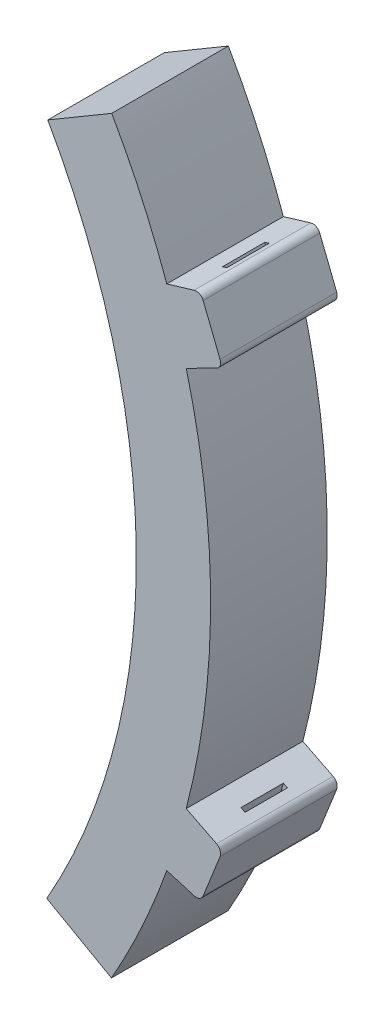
from build123d import *

# Parameters (mm, degrees)
EXTRUSION1_DEPTH      = 30.634894
EXTRUSION1_DEPTH_BACK = 47.865106
ESQUISSE2_W           = 3
ESQUISSE2_H           = 28.5


with BuildPart() as part:
    # Esquisse1 → Extrusion1 (new, two sides: drawn at the far end of the back side and taken through both)
    with BuildSketch(Plane.XY.offset(-EXTRUSION1_DEPTH_BACK)):
        with BuildLine():
            Line((-151.468299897, 244.059905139), (-108.390260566, 269.456728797))
            ThreePointArc((-108.390260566, 269.456728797), (-88.098968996, 229.800143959), (-71.345615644, 188.524165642))
            Line((-71.345615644, 188.524165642), (-59.356876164, 192.117549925))
            Line((-59.356876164, 192.117549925), (-56.47968522, 192.979930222))
            Line((-56.47968522, 192.979930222), (-52.93338842, 194.042861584))
            ThreePointArc((-52.93338842, 194.042861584), (-49.320505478, 193.754400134), (-46.851690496, 191.100895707))
            Line((-46.851690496, 191.100895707), (-35.460812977, 162.455126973))
            ThreePointArc((-35.460812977, 162.455126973), (-35.433293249, 158.83085107), (-37.861528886, 156.140162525))
            Line((-37.861528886, 156.140162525), (-44.090722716, 153.00924093))
            Line((-44.090722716, 153.00924093), (-46.828859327, 151.632996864))
            Line((-46.828859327, 151.632996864), (-58.245311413, 145.894852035))
            ThreePointArc((-58.245311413, 145.894852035), (-41.829281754, 17.540404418), (-58.245311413, -110.814043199))
            Line((-58.245311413, -110.814043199), (-46.828859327, -116.552188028))
            Line((-46.828859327, -116.552188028), (-44.090722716, -117.928432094))
            Line((-44.090722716, -117.928432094), (-37.861528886, -121.059353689))
            ThreePointArc((-37.861528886, -121.059353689), (-35.433293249, -123.750042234), (-35.460812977, -127.374318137))
            Line((-35.460812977, -127.374318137), (-46.851690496, -156.020086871))
            ThreePointArc((-46.851690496, -156.020086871), (-49.320505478, -158.673591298), (-52.93338842, -158.962052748))
            Line((-52.93338842, -158.962052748), (-56.47968522, -157.899121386))
            Line((-56.47968522, -157.899121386), (-59.356876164, -157.036741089))
            Line((-59.356876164, -157.036741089), (-71.345615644, -153.443356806))
            ThreePointArc((-71.345615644, -153.443356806), (-88.183862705, -194.904707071), (-108.591823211, -234.730393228))
            Line((-108.591823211, -234.730393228), (-152.119111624, -210.125534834))
            ThreePointArc((-152.119111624, -210.125534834), (-91.829754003, 16.881261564), (-151.468299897, 244.059905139))
        make_face()
    extrude(amount=EXTRUSION1_DEPTH + EXTRUSION1_DEPTH_BACK)

    # Enl_vement de mati_re-Balayage1: sweep along a path in Esquisse3
    with BuildLine(Plane.XY.offset(30.634893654)) as enl_vement_de_mati_re_balayage1_path:
        CenterArc((-551.829281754, 17.540404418), 523, 0, 360)
    # Esquisse2 → Enl_vement de mati_re-Balayage1 (sweep, cut)
    with BuildSketch(Plane(origin=(-126.852225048, -224.408256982, 0), x_dir=(0.8705416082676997, -0.4920948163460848, 0), z_dir=(-0.4920948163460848, -0.8705416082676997, 0))):
        with Locations((35.475909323, -8.615106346)):
            Rectangle(ESQUISSE2_W, ESQUISSE2_H)
    sweep(path=enl_vement_de_mati_re_balayage1_path.line, mode=Mode.SUBTRACT)


solid = part.part
